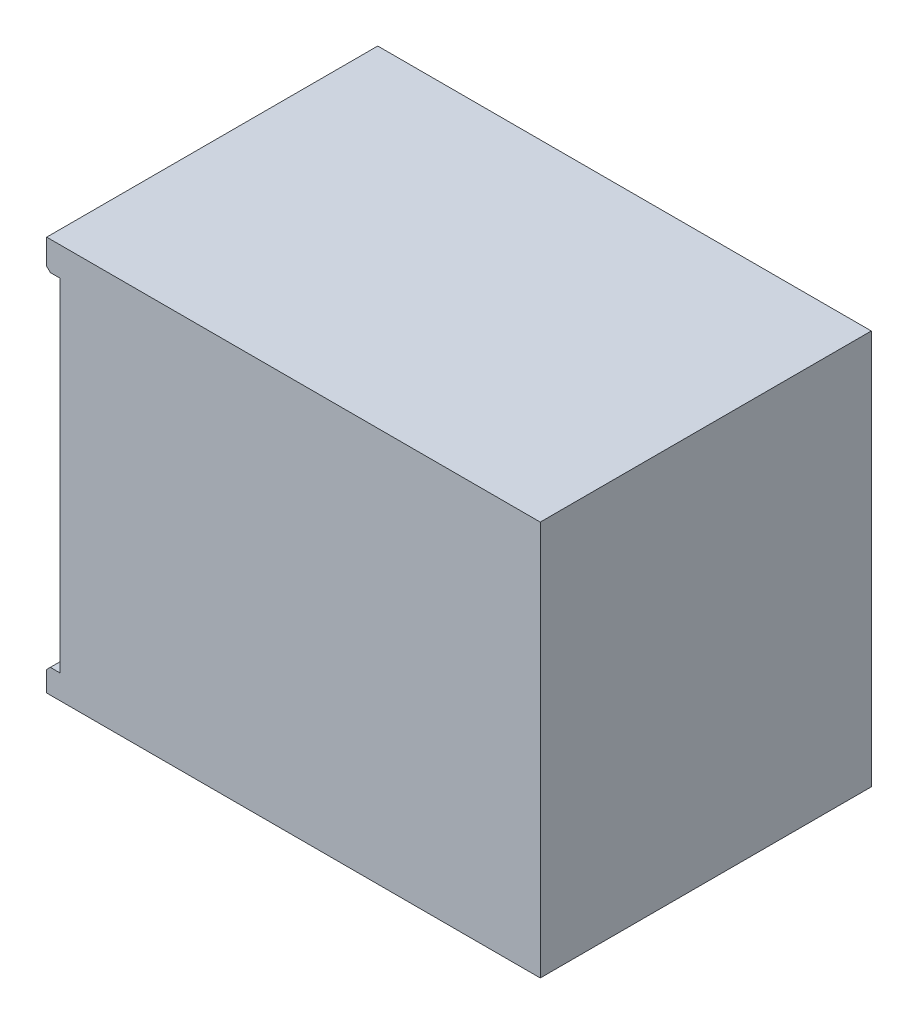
from build123d import *

# Parameters (mm, degrees)
EXTRUDE1_DEPTH                  = 17.4625
F_6_32_TAPPED_HOLE1_D           = 2.7051
F_6_32_TAPPED_HOLE1_DEPTH       = 9.99744
F_6_32_TAPPED_HOLE1_CBORE_D     = 3.5052
F_6_32_TAPPED_HOLE1_CBORE_DEPTH = 7.62
F_6_32_TAPPED_HOLE1_TIP         = 0.81269403
CHAMFER1_SIZE                   = 0.381


with BuildPart() as part:
    # Sketch1 → Extrude1 (new, symmetric)
    with BuildSketch(Plane.XY):
        Polygon((50.673, 0), (50.673, -41.656), (-1.397, -41.656), (-1.397, -39.116), (0, -39.116), (0, -3.048), (-1.397, -3.048), (-1.397, 0), align=None)
    extrude(amount=EXTRUDE1_DEPTH, both=True)

    # 6-32 Tapped Hole1
    with Locations(Plane(origin=(0, -29.21, -13.97), x_dir=(0, 0, -1), z_dir=(-1, 0, 0))):
        with Locations((0, 0), (-27.94, -16.764)):
            CounterBoreHole(F_6_32_TAPPED_HOLE1_D / 2, F_6_32_TAPPED_HOLE1_CBORE_D / 2, F_6_32_TAPPED_HOLE1_CBORE_DEPTH, depth=F_6_32_TAPPED_HOLE1_DEPTH)
            with Locations((0, 0, -(F_6_32_TAPPED_HOLE1_DEPTH + F_6_32_TAPPED_HOLE1_TIP / 2))):  # 118° drill point
                Cone(0, F_6_32_TAPPED_HOLE1_D / 2, F_6_32_TAPPED_HOLE1_TIP, mode=Mode.SUBTRACT)

    # Chamfer1
    chamfer1_edges = [part.edges().sort_by_distance(p)[0] for p in [
        (-1.397, -39.116, 0),
        (-1.397, -3.048, 0),
    ]]
    chamfer(chamfer1_edges, length=CHAMFER1_SIZE)


solid = part.part
